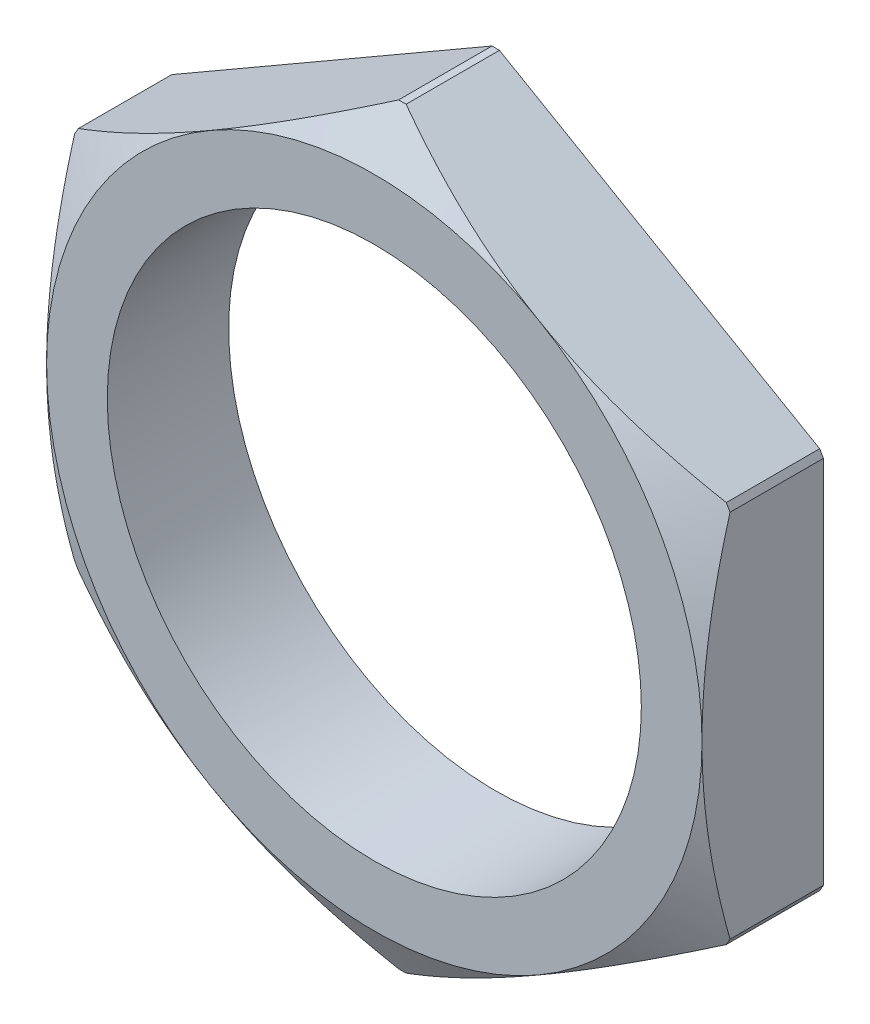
ISO-10303-21;
HEADER;
FILE_DESCRIPTION(('STEP AP214'),'2;1');
FILE_NAME('part.step','',(''),(''),'','','');
FILE_SCHEMA(('AUTOMOTIVE_DESIGN { 1 0 10303 214 1 1 1 1 }'));
ENDSEC;
DATA;
#1=APPLICATION_CONTEXT('core data for automotive mechanical design processes');
#2=APPLICATION_PROTOCOL_DEFINITION('international standard','automotive_design',2000,#1);
#3=PRODUCT_CONTEXT('',#1,'mechanical');
#4=PRODUCT('Part','Part','',(#3));
#5=PRODUCT_RELATED_PRODUCT_CATEGORY('part','',(#4));
#6=PRODUCT_DEFINITION_FORMATION('','',#4);
#7=PRODUCT_DEFINITION_CONTEXT('part definition',#1,'design');
#8=PRODUCT_DEFINITION('design','',#6,#7);
#9=PRODUCT_DEFINITION_SHAPE('','',#8);
#10=(LENGTH_UNIT() NAMED_UNIT(*) SI_UNIT(.MILLI.,.METRE.));
#11=(NAMED_UNIT(*) PLANE_ANGLE_UNIT() SI_UNIT($,.RADIAN.));
#12=(NAMED_UNIT(*) SI_UNIT($,.STERADIAN.) SOLID_ANGLE_UNIT());
#13=UNCERTAINTY_MEASURE_WITH_UNIT(LENGTH_MEASURE(1.E-05),#10,'distance_accuracy_value','');
#14=(GEOMETRIC_REPRESENTATION_CONTEXT(3) GLOBAL_UNCERTAINTY_ASSIGNED_CONTEXT((#13)) GLOBAL_UNIT_ASSIGNED_CONTEXT((#10,
#11,#12)) REPRESENTATION_CONTEXT('',''));
#15=CARTESIAN_POINT('',(0.,0.,0.));
#16=DIRECTION('',(0.,0.,1.));
#17=DIRECTION('',(1.,0.,0.));
#18=AXIS2_PLACEMENT_3D('',#15,#16,#17);
#19=CARTESIAN_POINT('',(0.,0.,5.));
#20=DIRECTION('',(0.,0.,-1.));
#21=DIRECTION('',(-1.,0.,0.));
#22=AXIS2_PLACEMENT_3D('',#19,#20,#21);
#23=CONICAL_SURFACE('',#22,13.5,1.0471975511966);
#24=CARTESIAN_POINT('',(-13.3460635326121,7.88310389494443,3.84509946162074));
#25=CARTESIAN_POINT('',(-13.050624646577,8.05367561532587,3.9418734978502));
#26=CARTESIAN_POINT('',(-12.7540346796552,8.22491191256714,4.03410660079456));
#27=CARTESIAN_POINT('',(-12.1584938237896,8.56874758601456,4.20825527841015));
#28=CARTESIAN_POINT('',(-11.8595421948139,8.74134738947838,4.29016747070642));
#29=CARTESIAN_POINT('',(-11.2587570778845,9.08821083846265,4.44253996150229));
#30=CARTESIAN_POINT('',(-10.9569187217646,9.26247729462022,4.51297485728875));
#31=CARTESIAN_POINT('',(-10.351193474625,9.61219292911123,4.64087642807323));
#32=CARTESIAN_POINT('',(-10.0473067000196,9.78764204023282,4.69834383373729));
#33=CARTESIAN_POINT('',(-9.44511925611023,10.1353151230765,4.79789147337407));
#34=CARTESIAN_POINT('',(-9.14686072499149,10.307514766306,4.84030952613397));
#35=CARTESIAN_POINT('',(-8.54905165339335,10.6526599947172,4.91070012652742));
#36=CARTESIAN_POINT('',(-8.24950108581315,10.8256055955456,4.93867236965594));
#37=CARTESIAN_POINT('',(-7.64996393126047,11.1717485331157,4.97946713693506));
#38=CARTESIAN_POINT('',(-7.34997822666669,11.344945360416,4.99230684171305));
#39=CARTESIAN_POINT('',(-6.74981470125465,11.6914499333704,5.00256554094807));
#40=CARTESIAN_POINT('',(-6.44963688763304,11.8647576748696,4.99998508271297));
#41=CARTESIAN_POINT('',(-5.89855620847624,12.182924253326,4.98114776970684));
#42=CARTESIAN_POINT('',(-5.64759204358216,12.3278184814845,4.96718726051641));
#43=CARTESIAN_POINT('',(-5.14625275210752,12.6172668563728,4.92876258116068));
#44=CARTESIAN_POINT('',(-4.89587766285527,12.7618209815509,4.90429776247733));
#45=CARTESIAN_POINT('',(-4.39584644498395,13.0505141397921,4.84525401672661));
#46=CARTESIAN_POINT('',(-4.14619096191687,13.1946528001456,4.81066783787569));
#47=CARTESIAN_POINT('',(-3.64800506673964,13.4822805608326,4.73193570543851));
#48=CARTESIAN_POINT('',(-3.39947472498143,13.6257696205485,4.68778916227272));
#49=CARTESIAN_POINT('',(-2.64559753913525,14.0610208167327,4.53993928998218));
#50=CARTESIAN_POINT('',(-2.14232624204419,14.3515846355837,4.42208977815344));
#51=CARTESIAN_POINT('',(-1.14286626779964,14.928623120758,4.15536068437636));
#52=CARTESIAN_POINT('',(-0.646666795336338,15.2151040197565,4.00653542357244));
#53=CARTESIAN_POINT('',(-0.153936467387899,15.4995820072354,3.84509946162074));
#54=B_SPLINE_CURVE_WITH_KNOTS('',3,(#24,#25,#26,#27,#28,#29,#30,#31,#32,#33,#34,#35,#36,#37,#38,
#39,#40,#41,#42,#43,#44,#45,#46,#47,#48,#49,#50,#51,#52,#53),.UNSPECIFIED.,.F.,.F.,(4,2,2,2,2,2,
2,2,2,2,2,2,2,2,4),(0.,1.06383959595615,2.12802693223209,3.19453854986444,4.26099005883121,
5.30170918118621,6.34245024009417,7.38200855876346,8.4215299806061,9.29171447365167,
10.161952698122,11.0328159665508,11.9037329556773,13.681588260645,15.4563516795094),.UNSPECIFIED.);
#55=CARTESIAN_POINT('',(-13.3454529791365,7.88345639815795,3.84529946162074));
#56=VERTEX_POINT('',#55);
#57=CARTESIAN_POINT('',(-6.75,11.6913429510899,5.));
#58=VERTEX_POINT('',#57);
#59=EDGE_CURVE('E334',#56,#58,#54,.T.);
#60=ORIENTED_EDGE('',*,*,#59,.F.);
#61=CARTESIAN_POINT('',(0.,0.,3.84529946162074));
#62=DIRECTION('',(0.,0.,-1.));
#63=DIRECTION('',(-1.,0.,0.));
#64=AXIS2_PLACEMENT_3D('',#61,#62,#63);
#65=CIRCLE('',#64,15.5);
#66=CARTESIAN_POINT('',(-13.5,7.61577310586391,3.84529946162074));
#67=VERTEX_POINT('',#66);
#68=EDGE_CURVE('E192',#67,#56,#65,.T.);
#69=ORIENTED_EDGE('',*,*,#68,.F.);
#70=CARTESIAN_POINT('',(-13.5,-20.664360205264,-1.4566869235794));
#71=CARTESIAN_POINT('',(-13.5,-20.3680355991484,-1.31346268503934));
#72=CARTESIAN_POINT('',(-13.5,-20.0713526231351,-1.17098026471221));
#73=CARTESIAN_POINT('',(-13.5,-19.4771942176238,-0.887669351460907));
#74=CARTESIAN_POINT('',(-13.5,-19.1797187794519,-0.746840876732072));
#75=CARTESIAN_POINT('',(-13.5,-18.2859029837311,-0.327050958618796));
#76=CARTESIAN_POINT('',(-13.5,-17.6882695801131,-0.0508317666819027));
#77=CARTESIAN_POINT('',(-13.5,-16.4854470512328,0.494091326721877));
#78=CARTESIAN_POINT('',(-13.5,-15.8802342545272,0.762743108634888));
#79=CARTESIAN_POINT('',(-13.5,-14.6648323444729,1.28850182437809));
#80=CARTESIAN_POINT('',(-13.5,-14.0546434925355,1.54560936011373));
#81=CARTESIAN_POINT('',(-13.5,-12.8207772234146,2.04824093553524));
#82=CARTESIAN_POINT('',(-13.5,-12.1970260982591,2.29358498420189));
#83=CARTESIAN_POINT('',(-13.5,-10.9421598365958,2.76504093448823));
#84=CARTESIAN_POINT('',(-13.5,-10.3110438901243,2.99115069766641));
#85=CARTESIAN_POINT('',(-13.5,-9.04176334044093,3.41805435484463));
#86=CARTESIAN_POINT('',(-13.5,-8.40361701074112,3.61890213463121));
#87=CARTESIAN_POINT('',(-13.5,-7.11819087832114,3.98876427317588));
#88=CARTESIAN_POINT('',(-13.5,-6.470914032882,4.15778869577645));
#89=CARTESIAN_POINT('',(-13.5,-5.49302735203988,4.38126720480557));
#90=CARTESIAN_POINT('',(-13.5,-5.16583222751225,4.45076204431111));
#91=CARTESIAN_POINT('',(-13.5,-4.509265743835,4.57863405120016));
#92=CARTESIAN_POINT('',(-13.5,-4.17989443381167,4.63701146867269));
#93=CARTESIAN_POINT('',(-13.5,-3.51919100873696,4.74161425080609));
#94=CARTESIAN_POINT('',(-13.5,-3.18785873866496,4.78783864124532));
#95=CARTESIAN_POINT('',(-13.5,-2.52363207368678,4.86720376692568));
#96=CARTESIAN_POINT('',(-13.5,-2.19073773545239,4.90034497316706));
#97=CARTESIAN_POINT('',(-13.5,-1.52596312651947,4.95265487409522));
#98=CARTESIAN_POINT('',(-13.5,-1.19408974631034,4.97191056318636));
#99=CARTESIAN_POINT('',(-13.5,-0.529826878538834,4.99634729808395));
#100=CARTESIAN_POINT('',(-13.5,-0.197437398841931,5.00152855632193));
#101=CARTESIAN_POINT('',(-13.5,0.467168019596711,4.99769359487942));
#102=CARTESIAN_POINT('',(-13.5,0.799383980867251,4.98868135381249));
#103=CARTESIAN_POINT('',(-13.5,1.46314646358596,4.95668325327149));
#104=CARTESIAN_POINT('',(-13.5,1.79469294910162,4.93369666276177));
#105=CARTESIAN_POINT('',(-13.5,2.59824248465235,4.86152960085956));
#106=CARTESIAN_POINT('',(-13.5,3.06962908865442,4.80534902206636));
#107=CARTESIAN_POINT('',(-13.5,4.00870475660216,4.66786897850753));
#108=CARTESIAN_POINT('',(-13.5,4.47639326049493,4.58656578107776));
#109=CARTESIAN_POINT('',(-13.5,5.87472987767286,4.30905074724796));
#110=CARTESIAN_POINT('',(-13.5,6.79882179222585,4.07941846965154));
#111=CARTESIAN_POINT('',(-13.5,8.18109511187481,3.6835166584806));
#112=CARTESIAN_POINT('',(-13.5,8.64650005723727,3.54103887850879));
#113=CARTESIAN_POINT('',(-13.5,9.57281363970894,3.24189268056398));
#114=CARTESIAN_POINT('',(-13.5,10.0337218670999,3.0852229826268));
#115=CARTESIAN_POINT('',(-13.5,10.948744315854,2.76103005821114));
#116=CARTESIAN_POINT('',(-13.5,11.4028821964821,2.59357304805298));
#117=CARTESIAN_POINT('',(-13.5,12.0812296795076,2.33514469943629));
#118=CARTESIAN_POINT('',(-13.5,12.306832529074,2.24780955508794));
#119=CARTESIAN_POINT('',(-13.5,12.757162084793,2.07092097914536));
#120=CARTESIAN_POINT('',(-13.5,12.9818888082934,1.98136759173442));
#121=CARTESIAN_POINT('',(-13.5,13.2062078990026,1.89080521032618));
#122=B_SPLINE_CURVE_WITH_KNOTS('',3,(#70,#71,#72,#73,#74,#75,#76,#77,#78,#79,#80,#81,#82,#83,
#84,#85,#86,#87,#88,#89,#90,#91,#92,#93,#94,#95,#96,#97,#98,#99,#100,#101,#102,#103,#104,#105,
#106,#107,#108,#109,#110,#111,#112,#113,#114,#115,#116,#117,#118,#119,#120,#121),.UNSPECIFIED.,
.F.,.F.,(4,2,2,2,2,2,2,2,2,2,2,2,2,2,2,2,2,2,2,2,2,2,2,2,2,4),(0.,0.987364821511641,
1.97474049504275,3.94981332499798,5.93620107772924,7.92248514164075,9.93304684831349,
11.9438317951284,13.950252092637,15.9560368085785,16.9593600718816,17.9626607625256,
18.9660418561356,19.9693868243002,20.9663897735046,21.9633776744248,22.960086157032,
23.9568467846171,25.3802059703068,26.8037767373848,29.6564036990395,31.1164657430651,
32.5766596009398,34.0286157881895,34.7543580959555,35.480085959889),.UNSPECIFIED.);
#123=CARTESIAN_POINT('',(-13.5,0.,5.));
#124=VERTEX_POINT('',#123);
#125=EDGE_CURVE('E315',#124,#67,#122,.T.);
#126=ORIENTED_EDGE('',*,*,#125,.F.);
#127=CARTESIAN_POINT('',(0.,0.,5.));
#128=DIRECTION('',(0.,0.,-1.));
#129=DIRECTION('',(-1.,0.,0.));
#130=AXIS2_PLACEMENT_3D('',#127,#128,#129);
#131=CIRCLE('',#130,13.5);
#132=EDGE_CURVE('E152',#124,#58,#131,.T.);
#133=ORIENTED_EDGE('',*,*,#132,.T.);
#134=EDGE_LOOP('',(#60,#69,#126,#133));
#135=FACE_BOUND('',#134,.T.);
#136=ADVANCED_FACE('F14',(#135),#23,.T.);
#137=CARTESIAN_POINT('',(-13.5,-7.61577310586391,3.84529946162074));
#138=VERTEX_POINT('',#137);
#139=EDGE_CURVE('E322',#138,#124,#122,.T.);
#140=ORIENTED_EDGE('',*,*,#139,.F.);
#141=CARTESIAN_POINT('',(-13.3454529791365,-7.88345639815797,3.84529946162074));
#142=VERTEX_POINT('',#141);
#143=EDGE_CURVE('E142',#142,#138,#65,.T.);
#144=ORIENTED_EDGE('',*,*,#143,.F.);
#145=CARTESIAN_POINT('',(-0.153936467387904,-15.4995820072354,3.84509946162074));
#146=CARTESIAN_POINT('',(-0.44937535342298,-15.329010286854,3.9418734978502));
#147=CARTESIAN_POINT('',(-0.745965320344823,-15.1577739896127,4.03410660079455));
#148=CARTESIAN_POINT('',(-1.34150617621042,-14.8139383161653,4.20825527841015));
#149=CARTESIAN_POINT('',(-1.64045780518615,-14.6413385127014,4.29016747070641));
#150=CARTESIAN_POINT('',(-2.24124292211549,-14.2944750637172,4.44253996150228));
#151=CARTESIAN_POINT('',(-2.54308127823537,-14.1202086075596,4.51297485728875));
#152=CARTESIAN_POINT('',(-3.14880652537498,-13.7704929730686,4.64087642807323));
#153=CARTESIAN_POINT('',(-3.45269329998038,-13.595043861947,4.69834383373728));
#154=CARTESIAN_POINT('',(-4.05488074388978,-13.2473707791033,4.79789147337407));
#155=CARTESIAN_POINT('',(-4.35313927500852,-13.0751711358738,4.84030952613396));
#156=CARTESIAN_POINT('',(-4.95094834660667,-12.7300259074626,4.91070012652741));
#157=CARTESIAN_POINT('',(-5.25049891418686,-12.5570803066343,4.93867236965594));
#158=CARTESIAN_POINT('',(-5.85003606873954,-12.2109373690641,4.97946713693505));
#159=CARTESIAN_POINT('',(-6.15002177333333,-12.0377405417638,4.99230684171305));
#160=CARTESIAN_POINT('',(-6.75018529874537,-11.6912359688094,5.00256554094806));
#161=CARTESIAN_POINT('',(-7.05036311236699,-11.5179282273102,4.99998508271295));
#162=CARTESIAN_POINT('',(-7.60144379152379,-11.1997616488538,4.98114776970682));
#163=CARTESIAN_POINT('',(-7.85240795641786,-11.0548674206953,4.9671872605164));
#164=CARTESIAN_POINT('',(-8.35374724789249,-10.7654190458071,4.92876258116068));
#165=CARTESIAN_POINT('',(-8.60412233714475,-10.6208649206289,4.90429776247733));
#166=CARTESIAN_POINT('',(-9.10415355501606,-10.3321717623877,4.8452540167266));
#167=CARTESIAN_POINT('',(-9.35380903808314,-10.1880331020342,4.81066783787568));
#168=CARTESIAN_POINT('',(-9.85199493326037,-9.9004053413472,4.7319357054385));
#169=CARTESIAN_POINT('',(-10.1005252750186,-9.7569162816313,4.68778916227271));
#170=CARTESIAN_POINT('',(-10.8544024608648,-9.32166508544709,4.53993928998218));
#171=CARTESIAN_POINT('',(-11.3576737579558,-9.03110126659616,4.42208977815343));
#172=CARTESIAN_POINT('',(-12.3571337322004,-8.45406278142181,4.15536068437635));
#173=CARTESIAN_POINT('',(-12.8533332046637,-8.16758188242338,4.00653542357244));
#174=CARTESIAN_POINT('',(-13.3460635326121,-7.88310389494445,3.84509946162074));
#175=B_SPLINE_CURVE_WITH_KNOTS('',3,(#145,#146,#147,#148,#149,#150,#151,#152,#153,#154,#155,
#156,#157,#158,#159,#160,#161,#162,#163,#164,#165,#166,#167,#168,#169,#170,#171,#172,#173,#174),
.UNSPECIFIED.,.F.,.F.,(4,2,2,2,2,2,2,2,2,2,2,2,2,2,4),(0.,1.06383959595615,2.12802693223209,
3.19453854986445,4.26099005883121,5.30170918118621,6.34245024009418,7.38200855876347,
8.42152998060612,9.29171447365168,10.161952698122,11.0328159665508,11.9037329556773,
13.681588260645,15.4563516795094),.UNSPECIFIED.);
#176=CARTESIAN_POINT('',(-6.75,-11.6913429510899,5.));
#177=VERTEX_POINT('',#176);
#178=EDGE_CURVE('E124',#177,#142,#175,.T.);
#179=ORIENTED_EDGE('',*,*,#178,.F.);
#180=EDGE_CURVE('E140',#177,#124,#131,.T.);
#181=ORIENTED_EDGE('',*,*,#180,.T.);
#182=EDGE_LOOP('',(#140,#144,#179,#181));
#183=FACE_BOUND('',#182,.T.);
#184=ADVANCED_FACE('F139',(#183),#23,.T.);
#185=CARTESIAN_POINT('',(-0.154547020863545,-15.4992295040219,3.84529946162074));
#186=VERTEX_POINT('',#185);
#187=EDGE_CURVE('E121',#186,#177,#175,.T.);
#188=ORIENTED_EDGE('',*,*,#187,.F.);
#189=CARTESIAN_POINT('',(0.15454702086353,-15.4992295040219,3.84529946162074));
#190=VERTEX_POINT('',#189);
#191=EDGE_CURVE('E271',#190,#186,#65,.T.);
#192=ORIENTED_EDGE('',*,*,#191,.F.);
#193=CARTESIAN_POINT('',(13.3460635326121,-7.88310389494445,3.84509946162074));
#194=CARTESIAN_POINT('',(13.050624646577,-8.05367561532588,3.9418734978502));
#195=CARTESIAN_POINT('',(12.7540346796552,-8.22491191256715,4.03410660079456));
#196=CARTESIAN_POINT('',(12.1584938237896,-8.56874758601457,4.20825527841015));
#197=CARTESIAN_POINT('',(11.8595421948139,-8.74134738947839,4.29016747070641));
#198=CARTESIAN_POINT('',(11.2587570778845,-9.08821083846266,4.44253996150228));
#199=CARTESIAN_POINT('',(10.9569187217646,-9.26247729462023,4.51297485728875));
#200=CARTESIAN_POINT('',(10.351193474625,-9.61219292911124,4.64087642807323));
#201=CARTESIAN_POINT('',(10.0473067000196,-9.78764204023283,4.69834383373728));
#202=CARTESIAN_POINT('',(9.44511925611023,-10.1353151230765,4.79789147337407));
#203=CARTESIAN_POINT('',(9.14686072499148,-10.307514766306,4.84030952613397));
#204=CARTESIAN_POINT('',(8.54905165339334,-10.6526599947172,4.91070012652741));
#205=CARTESIAN_POINT('',(8.24950108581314,-10.8256055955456,4.93867236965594));
#206=CARTESIAN_POINT('',(7.64996393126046,-11.1717485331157,4.97946713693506));
#207=CARTESIAN_POINT('',(7.34997822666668,-11.344945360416,4.99230684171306));
#208=CARTESIAN_POINT('',(6.74981470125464,-11.6914499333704,5.00256554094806));
#209=CARTESIAN_POINT('',(6.44963688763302,-11.8647576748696,4.99998508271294));
#210=CARTESIAN_POINT('',(5.89855620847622,-12.182924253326,4.98114776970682));
#211=CARTESIAN_POINT('',(5.64759204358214,-12.3278184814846,4.9671872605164));
#212=CARTESIAN_POINT('',(5.14625275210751,-12.6172668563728,4.92876258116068));
#213=CARTESIAN_POINT('',(4.89587766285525,-12.7618209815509,4.90429776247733));
#214=CARTESIAN_POINT('',(4.39584644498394,-13.0505141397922,4.84525401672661));
#215=CARTESIAN_POINT('',(4.14619096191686,-13.1946528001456,4.81066783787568));
#216=CARTESIAN_POINT('',(3.64800506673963,-13.4822805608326,4.7319357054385));
#217=CARTESIAN_POINT('',(3.39947472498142,-13.6257696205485,4.68778916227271));
#218=CARTESIAN_POINT('',(2.64559753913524,-14.0610208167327,4.53993928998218));
#219=CARTESIAN_POINT('',(2.14232624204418,-14.3515846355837,4.42208977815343));
#220=CARTESIAN_POINT('',(1.14286626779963,-14.928623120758,4.15536068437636));
#221=CARTESIAN_POINT('',(0.646666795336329,-15.2151040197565,4.00653542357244));
#222=CARTESIAN_POINT('',(0.15393646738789,-15.4995820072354,3.84509946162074));
#223=B_SPLINE_CURVE_WITH_KNOTS('',3,(#193,#194,#195,#196,#197,#198,#199,#200,#201,#202,#203,
#204,#205,#206,#207,#208,#209,#210,#211,#212,#213,#214,#215,#216,#217,#218,#219,#220,#221,#222),
.UNSPECIFIED.,.F.,.F.,(4,2,2,2,2,2,2,2,2,2,2,2,2,2,4),(0.,1.06383959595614,2.12802693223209,
3.19453854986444,4.26099005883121,5.30170918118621,6.34245024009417,7.38200855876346,
8.42152998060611,9.29171447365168,10.161952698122,11.0328159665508,11.9037329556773,
13.681588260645,15.4563516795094),.UNSPECIFIED.);
#224=CARTESIAN_POINT('',(6.75,-11.6913429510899,5.));
#225=VERTEX_POINT('',#224);
#226=EDGE_CURVE('E156',#225,#190,#223,.T.);
#227=ORIENTED_EDGE('',*,*,#226,.F.);
#228=EDGE_CURVE('E149',#225,#177,#131,.T.);
#229=ORIENTED_EDGE('',*,*,#228,.T.);
#230=EDGE_LOOP('',(#188,#192,#227,#229));
#231=FACE_BOUND('',#230,.T.);
#232=ADVANCED_FACE('F155',(#231),#23,.T.);
#233=CARTESIAN_POINT('',(0.,0.,-10.));
#234=DIRECTION('',(0.,0.,-1.));
#235=DIRECTION('',(-1.,0.,0.));
#236=AXIS2_PLACEMENT_3D('',#233,#234,#235);
#237=CYLINDRICAL_SURFACE('',#236,15.5);
#238=DIRECTION('',(0.,0.,-1.));
#239=VECTOR('',#238,1.);
#240=CARTESIAN_POINT('',(-13.3454529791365,7.88345639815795,-10.));
#241=LINE('',#240,#239);
#242=CARTESIAN_POINT('',(-13.3454529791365,7.88345639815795,0.));
#243=VERTEX_POINT('',#242);
#244=EDGE_CURVE('E325',#243,#56,#241,.F.);
#245=ORIENTED_EDGE('',*,*,#244,.F.);
#246=CARTESIAN_POINT('',(0.,0.,0.));
#247=DIRECTION('',(0.,0.,-1.));
#248=DIRECTION('',(-1.,0.,0.));
#249=AXIS2_PLACEMENT_3D('',#246,#247,#248);
#250=CIRCLE('',#249,15.5);
#251=CARTESIAN_POINT('',(-13.5,7.61577310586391,0.));
#252=VERTEX_POINT('',#251);
#253=EDGE_CURVE('E193',#252,#243,#250,.T.);
#254=ORIENTED_EDGE('',*,*,#253,.F.);
#255=DIRECTION('',(0.,0.,-1.));
#256=VECTOR('',#255,1.);
#257=CARTESIAN_POINT('',(-13.5,7.61577310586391,-10.));
#258=LINE('',#257,#256);
#259=EDGE_CURVE('E37',#67,#252,#258,.T.);
#260=ORIENTED_EDGE('',*,*,#259,.F.);
#261=ORIENTED_EDGE('',*,*,#68,.T.);
#262=EDGE_LOOP('',(#245,#254,#260,#261));
#263=FACE_BOUND('',#262,.T.);
#264=ADVANCED_FACE('F219',(#263),#237,.T.);
#265=DIRECTION('',(0.,0.,-1.));
#266=VECTOR('',#265,1.);
#267=CARTESIAN_POINT('',(-13.5,-7.61577310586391,-10.));
#268=LINE('',#267,#266);
#269=CARTESIAN_POINT('',(-13.5,-7.61577310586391,0.));
#270=VERTEX_POINT('',#269);
#271=EDGE_CURVE('E480',#270,#138,#268,.F.);
#272=ORIENTED_EDGE('',*,*,#271,.F.);
#273=CARTESIAN_POINT('',(-13.3454529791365,-7.88345639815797,0.));
#274=VERTEX_POINT('',#273);
#275=EDGE_CURVE('E282',#274,#270,#250,.T.);
#276=ORIENTED_EDGE('',*,*,#275,.F.);
#277=DIRECTION('',(0.,0.,-1.));
#278=VECTOR('',#277,1.);
#279=CARTESIAN_POINT('',(-13.3454529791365,-7.88345639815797,-10.));
#280=LINE('',#279,#278);
#281=EDGE_CURVE('E143',#142,#274,#280,.T.);
#282=ORIENTED_EDGE('',*,*,#281,.F.);
#283=ORIENTED_EDGE('',*,*,#143,.T.);
#284=EDGE_LOOP('',(#272,#276,#282,#283));
#285=FACE_BOUND('',#284,.T.);
#286=ADVANCED_FACE('F221',(#285),#237,.T.);
#287=DIRECTION('',(0.,0.,-1.));
#288=VECTOR('',#287,1.);
#289=CARTESIAN_POINT('',(-0.154547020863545,-15.4992295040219,-10.));
#290=LINE('',#289,#288);
#291=CARTESIAN_POINT('',(-0.154547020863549,-15.4992295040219,0.));
#292=VERTEX_POINT('',#291);
#293=EDGE_CURVE('E127',#292,#186,#290,.F.);
#294=ORIENTED_EDGE('',*,*,#293,.F.);
#295=CARTESIAN_POINT('',(0.154547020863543,-15.4992295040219,0.));
#296=VERTEX_POINT('',#295);
#297=EDGE_CURVE('E194',#296,#292,#250,.T.);
#298=ORIENTED_EDGE('',*,*,#297,.F.);
#299=DIRECTION('',(0.,0.,-1.));
#300=VECTOR('',#299,1.);
#301=CARTESIAN_POINT('',(0.15454702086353,-15.4992295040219,-10.));
#302=LINE('',#301,#300);
#303=EDGE_CURVE('E203',#190,#296,#302,.T.);
#304=ORIENTED_EDGE('',*,*,#303,.F.);
#305=ORIENTED_EDGE('',*,*,#191,.T.);
#306=EDGE_LOOP('',(#294,#298,#304,#305));
#307=FACE_BOUND('',#306,.T.);
#308=ADVANCED_FACE('F217',(#307),#237,.T.);
#309=CARTESIAN_POINT('',(0.,15.5,0.));
#310=DIRECTION('',(0.,0.,1.));
#311=DIRECTION('',(1.,0.,0.));
#312=AXIS2_PLACEMENT_3D('',#309,#310,#311);
#313=PLANE('',#312);
#314=CARTESIAN_POINT('',(0.,0.,0.));
#315=DIRECTION('',(0.,0.,1.));
#316=DIRECTION('',(1.,0.,0.));
#317=AXIS2_PLACEMENT_3D('',#314,#315,#316);
#318=CIRCLE('',#317,11.);
#319=CARTESIAN_POINT('',(11.,0.,0.));
#320=VERTEX_POINT('',#319);
#321=EDGE_CURVE('E293',#320,#320,#318,.T.);
#322=ORIENTED_EDGE('',*,*,#321,.T.);
#323=EDGE_LOOP('',(#322));
#324=FACE_BOUND('',#323,.T.);
#325=DIRECTION('',(-0.866025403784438,-0.5,0.));
#326=VECTOR('',#325,1.);
#327=CARTESIAN_POINT('',(-0.0383031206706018,15.5663429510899,0.));
#328=LINE('',#327,#326);
#329=CARTESIAN_POINT('',(-0.154547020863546,15.4992295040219,0.));
#330=VERTEX_POINT('',#329);
#331=EDGE_CURVE('E323',#330,#243,#328,.T.);
#332=ORIENTED_EDGE('',*,*,#331,.F.);
#333=CARTESIAN_POINT('',(0.154547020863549,15.4992295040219,0.));
#334=VERTEX_POINT('',#333);
#335=EDGE_CURVE('E29',#330,#334,#250,.T.);
#336=ORIENTED_EDGE('',*,*,#335,.T.);
#337=DIRECTION('',(-0.866025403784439,0.5,0.));
#338=VECTOR('',#337,1.);
#339=CARTESIAN_POINT('',(0.0383031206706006,15.5663429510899,0.));
#340=LINE('',#339,#338);
#341=CARTESIAN_POINT('',(13.3454529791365,7.88345639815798,0.));
#342=VERTEX_POINT('',#341);
#343=EDGE_CURVE('E163',#342,#334,#340,.T.);
#344=ORIENTED_EDGE('',*,*,#343,.F.);
#345=CARTESIAN_POINT('',(13.5,7.61577310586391,0.));
#346=VERTEX_POINT('',#345);
#347=EDGE_CURVE('E183',#342,#346,#250,.T.);
#348=ORIENTED_EDGE('',*,*,#347,.T.);
#349=DIRECTION('',(0.,1.,0.));
#350=VECTOR('',#349,1.);
#351=CARTESIAN_POINT('',(13.5,15.5,0.));
#352=LINE('',#351,#350);
#353=CARTESIAN_POINT('',(13.5,-7.61577310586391,0.));
#354=VERTEX_POINT('',#353);
#355=EDGE_CURVE('E22',#354,#346,#352,.T.);
#356=ORIENTED_EDGE('',*,*,#355,.F.);
#357=CARTESIAN_POINT('',(13.3454529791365,-7.88345639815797,0.));
#358=VERTEX_POINT('',#357);
#359=EDGE_CURVE('E191',#354,#358,#250,.T.);
#360=ORIENTED_EDGE('',*,*,#359,.T.);
#361=DIRECTION('',(0.866025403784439,0.5,0.));
#362=VECTOR('',#361,1.);
#363=CARTESIAN_POINT('',(13.4616968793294,-7.81634295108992,0.));
#364=LINE('',#363,#362);
#365=EDGE_CURVE('E9',#296,#358,#364,.T.);
#366=ORIENTED_EDGE('',*,*,#365,.F.);
#367=ORIENTED_EDGE('',*,*,#297,.T.);
#368=DIRECTION('',(0.866025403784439,-0.5,0.));
#369=VECTOR('',#368,1.);
#370=CARTESIAN_POINT('',(-13.4616968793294,-7.81634295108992,0.));
#371=LINE('',#370,#369);
#372=EDGE_CURVE('E290',#274,#292,#371,.T.);
#373=ORIENTED_EDGE('',*,*,#372,.F.);
#374=ORIENTED_EDGE('',*,*,#275,.T.);
#375=DIRECTION('',(0.,-1.,0.));
#376=VECTOR('',#375,1.);
#377=CARTESIAN_POINT('',(-13.5,15.5,0.));
#378=LINE('',#377,#376);
#379=EDGE_CURVE('E132',#252,#270,#378,.T.);
#380=ORIENTED_EDGE('',*,*,#379,.F.);
#381=ORIENTED_EDGE('',*,*,#253,.T.);
#382=EDGE_LOOP('',(#332,#336,#344,#348,#356,#360,#366,#367,#373,#374,#380,#381));
#383=FACE_BOUND('',#382,.T.);
#384=ADVANCED_FACE('F190',(#324,#383),#313,.F.);
#385=CARTESIAN_POINT('',(13.3454529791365,-7.88345639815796,3.84529946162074));
#386=VERTEX_POINT('',#385);
#387=EDGE_CURVE('E202',#386,#225,#223,.T.);
#388=ORIENTED_EDGE('',*,*,#387,.F.);
#389=CARTESIAN_POINT('',(13.5,-7.61577310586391,3.84529946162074));
#390=VERTEX_POINT('',#389);
#391=EDGE_CURVE('E268',#390,#386,#65,.T.);
#392=ORIENTED_EDGE('',*,*,#391,.F.);
#393=CARTESIAN_POINT('',(13.5,-20.664360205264,-1.45668692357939));
#394=CARTESIAN_POINT('',(13.5,-20.3680355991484,-1.31346268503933));
#395=CARTESIAN_POINT('',(13.5,-20.0713526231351,-1.17098026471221));
#396=CARTESIAN_POINT('',(13.5,-19.4771942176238,-0.887669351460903));
#397=CARTESIAN_POINT('',(13.5,-19.1797187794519,-0.746840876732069));
#398=CARTESIAN_POINT('',(13.5,-18.2859029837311,-0.327050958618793));
#399=CARTESIAN_POINT('',(13.5,-17.6882695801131,-0.0508317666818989));
#400=CARTESIAN_POINT('',(13.5,-16.4854470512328,0.494091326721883));
#401=CARTESIAN_POINT('',(13.5,-15.8802342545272,0.762743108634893));
#402=CARTESIAN_POINT('',(13.5,-14.6648323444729,1.2885018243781));
#403=CARTESIAN_POINT('',(13.5,-14.0546434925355,1.54560936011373));
#404=CARTESIAN_POINT('',(13.5,-12.8207772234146,2.04824093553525));
#405=CARTESIAN_POINT('',(13.5,-12.1970260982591,2.29358498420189));
#406=CARTESIAN_POINT('',(13.5,-10.9421598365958,2.76504093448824));
#407=CARTESIAN_POINT('',(13.5,-10.3110438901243,2.99115069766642));
#408=CARTESIAN_POINT('',(13.5,-9.04176334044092,3.41805435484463));
#409=CARTESIAN_POINT('',(13.5,-8.40361701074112,3.61890213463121));
#410=CARTESIAN_POINT('',(13.5,-7.11819087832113,3.98876427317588));
#411=CARTESIAN_POINT('',(13.5,-6.47091403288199,4.15778869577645));
#412=CARTESIAN_POINT('',(13.5,-5.49302735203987,4.38126720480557));
#413=CARTESIAN_POINT('',(13.5,-5.16583222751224,4.45076204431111));
#414=CARTESIAN_POINT('',(13.5,-4.50926574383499,4.57863405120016));
#415=CARTESIAN_POINT('',(13.5,-4.17989443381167,4.63701146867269));
#416=CARTESIAN_POINT('',(13.5,-3.51919100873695,4.74161425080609));
#417=CARTESIAN_POINT('',(13.5,-3.18785873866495,4.78783864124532));
#418=CARTESIAN_POINT('',(13.5,-2.52363207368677,4.86720376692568));
#419=CARTESIAN_POINT('',(13.5,-2.19073773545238,4.90034497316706));
#420=CARTESIAN_POINT('',(13.5,-1.52596312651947,4.95265487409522));
#421=CARTESIAN_POINT('',(13.5,-1.19408974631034,4.97191056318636));
#422=CARTESIAN_POINT('',(13.5,-0.529826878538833,4.99634729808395));
#423=CARTESIAN_POINT('',(13.5,-0.197437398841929,5.00152855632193));
#424=CARTESIAN_POINT('',(13.5,0.467168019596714,4.99769359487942));
#425=CARTESIAN_POINT('',(13.5,0.799383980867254,4.98868135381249));
#426=CARTESIAN_POINT('',(13.5,1.46314646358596,4.95668325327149));
#427=CARTESIAN_POINT('',(13.5,1.79469294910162,4.93369666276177));
#428=CARTESIAN_POINT('',(13.5,2.59824248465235,4.86152960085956));
#429=CARTESIAN_POINT('',(13.5,3.06962908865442,4.80534902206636));
#430=CARTESIAN_POINT('',(13.5,4.00870475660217,4.66786897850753));
#431=CARTESIAN_POINT('',(13.5,4.47639326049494,4.58656578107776));
#432=CARTESIAN_POINT('',(13.5,5.87472987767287,4.30905074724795));
#433=CARTESIAN_POINT('',(13.5,6.79882179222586,4.07941846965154));
#434=CARTESIAN_POINT('',(13.5,8.18109511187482,3.6835166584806));
#435=CARTESIAN_POINT('',(13.5,8.64650005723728,3.54103887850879));
#436=CARTESIAN_POINT('',(13.5,9.57281363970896,3.24189268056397));
#437=CARTESIAN_POINT('',(13.5,10.0337218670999,3.08522298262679));
#438=CARTESIAN_POINT('',(13.5,10.9487443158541,2.76103005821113));
#439=CARTESIAN_POINT('',(13.5,11.4028821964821,2.59357304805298));
#440=CARTESIAN_POINT('',(13.5,12.0812296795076,2.33514469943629));
#441=CARTESIAN_POINT('',(13.5,12.306832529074,2.24780955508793));
#442=CARTESIAN_POINT('',(13.5,12.757162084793,2.07092097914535));
#443=CARTESIAN_POINT('',(13.5,12.9818888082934,1.98136759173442));
#444=CARTESIAN_POINT('',(13.5,13.2062078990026,1.89080521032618));
#445=B_SPLINE_CURVE_WITH_KNOTS('',3,(#393,#394,#395,#396,#397,#398,#399,#400,#401,#402,#403,
#404,#405,#406,#407,#408,#409,#410,#411,#412,#413,#414,#415,#416,#417,#418,#419,#420,#421,#422,
#423,#424,#425,#426,#427,#428,#429,#430,#431,#432,#433,#434,#435,#436,#437,#438,#439,#440,#441,
#442,#443,#444),.UNSPECIFIED.,.F.,.F.,(4,2,2,2,2,2,2,2,2,2,2,2,2,2,2,2,2,2,2,2,2,2,2,2,2,4),(0.,
0.987364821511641,1.97474049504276,3.94981332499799,5.93620107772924,7.92248514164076,
9.93304684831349,11.9438317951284,13.950252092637,15.9560368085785,16.9593600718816,
17.9626607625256,18.9660418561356,19.9693868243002,20.9663897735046,21.9633776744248,
22.960086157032,23.9568467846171,25.3802059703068,26.8037767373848,29.6564036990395,
31.1164657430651,32.5766596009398,34.0286157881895,34.7543580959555,35.480085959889),.UNSPECIFIED.);
#446=CARTESIAN_POINT('',(13.5,0.,5.));
#447=VERTEX_POINT('',#446);
#448=EDGE_CURVE('E280',#447,#390,#445,.F.);
#449=ORIENTED_EDGE('',*,*,#448,.F.);
#450=EDGE_CURVE('E157',#447,#225,#131,.T.);
#451=ORIENTED_EDGE('',*,*,#450,.T.);
#452=EDGE_LOOP('',(#388,#392,#449,#451));
#453=FACE_BOUND('',#452,.T.);
#454=ADVANCED_FACE('F205',(#453),#23,.T.);
#455=CARTESIAN_POINT('',(13.5,7.61577310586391,3.84529946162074));
#456=VERTEX_POINT('',#455);
#457=EDGE_CURVE('E489',#456,#447,#445,.F.);
#458=ORIENTED_EDGE('',*,*,#457,.F.);
#459=CARTESIAN_POINT('',(13.3454529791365,7.88345639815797,3.84529946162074));
#460=VERTEX_POINT('',#459);
#461=EDGE_CURVE('E185',#460,#456,#65,.T.);
#462=ORIENTED_EDGE('',*,*,#461,.F.);
#463=CARTESIAN_POINT('',(0.153936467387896,15.4995820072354,3.84509946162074));
#464=CARTESIAN_POINT('',(0.449375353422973,15.329010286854,3.9418734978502));
#465=CARTESIAN_POINT('',(0.745965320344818,15.1577739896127,4.03410660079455));
#466=CARTESIAN_POINT('',(1.34150617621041,14.8139383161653,4.20825527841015));
#467=CARTESIAN_POINT('',(1.64045780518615,14.6413385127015,4.29016747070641));
#468=CARTESIAN_POINT('',(2.24124292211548,14.2944750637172,4.44253996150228));
#469=CARTESIAN_POINT('',(2.54308127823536,14.1202086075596,4.51297485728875));
#470=CARTESIAN_POINT('',(3.14880652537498,13.7704929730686,4.64087642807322));
#471=CARTESIAN_POINT('',(3.45269329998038,13.595043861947,4.69834383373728));
#472=CARTESIAN_POINT('',(4.05488074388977,13.2473707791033,4.79789147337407));
#473=CARTESIAN_POINT('',(4.35313927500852,13.0751711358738,4.84030952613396));
#474=CARTESIAN_POINT('',(4.95094834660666,12.7300259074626,4.91070012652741));
#475=CARTESIAN_POINT('',(5.25049891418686,12.5570803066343,4.93867236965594));
#476=CARTESIAN_POINT('',(5.85003606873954,12.2109373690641,4.97946713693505));
#477=CARTESIAN_POINT('',(6.15002177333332,12.0377405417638,4.99230684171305));
#478=CARTESIAN_POINT('',(6.75018529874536,11.6912359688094,5.00256554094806));
#479=CARTESIAN_POINT('',(7.05036311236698,11.5179282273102,4.99998508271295));
#480=CARTESIAN_POINT('',(7.60144379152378,11.1997616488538,4.98114776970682));
#481=CARTESIAN_POINT('',(7.85240795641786,11.0548674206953,4.9671872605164));
#482=CARTESIAN_POINT('',(8.35374724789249,10.7654190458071,4.92876258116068));
#483=CARTESIAN_POINT('',(8.60412233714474,10.6208649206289,4.90429776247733));
#484=CARTESIAN_POINT('',(9.10415355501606,10.3321717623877,4.8452540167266));
#485=CARTESIAN_POINT('',(9.35380903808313,10.1880331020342,4.81066783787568));
#486=CARTESIAN_POINT('',(9.85199493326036,9.9004053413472,4.7319357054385));
#487=CARTESIAN_POINT('',(10.1005252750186,9.7569162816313,4.68778916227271));
#488=CARTESIAN_POINT('',(10.8544024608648,9.3216650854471,4.53993928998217));
#489=CARTESIAN_POINT('',(11.3576737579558,9.03110126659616,4.42208977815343));
#490=CARTESIAN_POINT('',(12.3571337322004,8.45406278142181,4.15536068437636));
#491=CARTESIAN_POINT('',(12.8533332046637,8.16758188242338,4.00653542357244));
#492=CARTESIAN_POINT('',(13.3460635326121,7.88310389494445,3.84509946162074));
#493=B_SPLINE_CURVE_WITH_KNOTS('',3,(#463,#464,#465,#466,#467,#468,#469,#470,#471,#472,#473,
#474,#475,#476,#477,#478,#479,#480,#481,#482,#483,#484,#485,#486,#487,#488,#489,#490,#491,#492),
.UNSPECIFIED.,.F.,.F.,(4,2,2,2,2,2,2,2,2,2,2,2,2,2,4),(0.,1.06383959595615,2.12802693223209,
3.19453854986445,4.26099005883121,5.30170918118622,6.34245024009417,7.38200855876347,
8.42152998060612,9.29171447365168,10.161952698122,11.0328159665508,11.9037329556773,
13.681588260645,15.4563516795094),.UNSPECIFIED.);
#494=CARTESIAN_POINT('',(6.75,11.6913429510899,5.));
#495=VERTEX_POINT('',#494);
#496=EDGE_CURVE('E264',#495,#460,#493,.T.);
#497=ORIENTED_EDGE('',*,*,#496,.F.);
#498=EDGE_CURVE('E158',#495,#447,#131,.T.);
#499=ORIENTED_EDGE('',*,*,#498,.T.);
#500=EDGE_LOOP('',(#458,#462,#497,#499));
#501=FACE_BOUND('',#500,.T.);
#502=ADVANCED_FACE('F231',(#501),#23,.T.);
#503=CARTESIAN_POINT('',(0.154547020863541,15.4992295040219,3.84529946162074));
#504=VERTEX_POINT('',#503);
#505=EDGE_CURVE('E186',#504,#495,#493,.T.);
#506=ORIENTED_EDGE('',*,*,#505,.F.);
#507=CARTESIAN_POINT('',(-0.154547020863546,15.4992295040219,3.84529946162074));
#508=VERTEX_POINT('',#507);
#509=EDGE_CURVE('E164',#508,#504,#65,.T.);
#510=ORIENTED_EDGE('',*,*,#509,.F.);
#511=EDGE_CURVE('E328',#58,#508,#54,.T.);
#512=ORIENTED_EDGE('',*,*,#511,.F.);
#513=EDGE_CURVE('E159',#58,#495,#131,.T.);
#514=ORIENTED_EDGE('',*,*,#513,.T.);
#515=EDGE_LOOP('',(#506,#510,#512,#514));
#516=FACE_BOUND('',#515,.T.);
#517=ADVANCED_FACE('F243',(#516),#23,.T.);
#518=DIRECTION('',(0.,0.,-1.));
#519=VECTOR('',#518,1.);
#520=CARTESIAN_POINT('',(13.3454529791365,-7.88345639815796,-10.));
#521=LINE('',#520,#519);
#522=EDGE_CURVE('E278',#358,#386,#521,.F.);
#523=ORIENTED_EDGE('',*,*,#522,.F.);
#524=ORIENTED_EDGE('',*,*,#359,.F.);
#525=DIRECTION('',(0.,0.,-1.));
#526=VECTOR('',#525,1.);
#527=CARTESIAN_POINT('',(13.5,-7.61577310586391,-10.));
#528=LINE('',#527,#526);
#529=EDGE_CURVE('E173',#390,#354,#528,.T.);
#530=ORIENTED_EDGE('',*,*,#529,.F.);
#531=ORIENTED_EDGE('',*,*,#391,.T.);
#532=EDGE_LOOP('',(#523,#524,#530,#531));
#533=FACE_BOUND('',#532,.T.);
#534=ADVANCED_FACE('F251',(#533),#237,.T.);
#535=DIRECTION('',(0.,0.,-1.));
#536=VECTOR('',#535,1.);
#537=CARTESIAN_POINT('',(13.5,7.61577310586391,-10.));
#538=LINE('',#537,#536);
#539=EDGE_CURVE('E170',#346,#456,#538,.F.);
#540=ORIENTED_EDGE('',*,*,#539,.F.);
#541=ORIENTED_EDGE('',*,*,#347,.F.);
#542=DIRECTION('',(0.,0.,-1.));
#543=VECTOR('',#542,1.);
#544=CARTESIAN_POINT('',(13.3454529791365,7.88345639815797,-10.));
#545=LINE('',#544,#543);
#546=EDGE_CURVE('E336',#460,#342,#545,.T.);
#547=ORIENTED_EDGE('',*,*,#546,.F.);
#548=ORIENTED_EDGE('',*,*,#461,.T.);
#549=EDGE_LOOP('',(#540,#541,#547,#548));
#550=FACE_BOUND('',#549,.T.);
#551=ADVANCED_FACE('F181',(#550),#237,.T.);
#552=DIRECTION('',(0.,0.,-1.));
#553=VECTOR('',#552,1.);
#554=CARTESIAN_POINT('',(0.154547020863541,15.4992295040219,-10.));
#555=LINE('',#554,#553);
#556=EDGE_CURVE('E266',#334,#504,#555,.F.);
#557=ORIENTED_EDGE('',*,*,#556,.F.);
#558=ORIENTED_EDGE('',*,*,#335,.F.);
#559=DIRECTION('',(0.,0.,-1.));
#560=VECTOR('',#559,1.);
#561=CARTESIAN_POINT('',(-0.154547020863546,15.4992295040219,-10.));
#562=LINE('',#561,#560);
#563=EDGE_CURVE('E267',#508,#330,#562,.T.);
#564=ORIENTED_EDGE('',*,*,#563,.F.);
#565=ORIENTED_EDGE('',*,*,#509,.T.);
#566=EDGE_LOOP('',(#557,#558,#564,#565));
#567=FACE_BOUND('',#566,.T.);
#568=ADVANCED_FACE('F223',(#567),#237,.T.);
#569=CARTESIAN_POINT('',(0.,0.,5.));
#570=DIRECTION('',(0.,0.,-1.));
#571=DIRECTION('',(-1.,0.,0.));
#572=AXIS2_PLACEMENT_3D('',#569,#570,#571);
#573=PLANE('',#572);
#574=ORIENTED_EDGE('',*,*,#513,.F.);
#575=ORIENTED_EDGE('',*,*,#132,.F.);
#576=ORIENTED_EDGE('',*,*,#180,.F.);
#577=ORIENTED_EDGE('',*,*,#228,.F.);
#578=ORIENTED_EDGE('',*,*,#450,.F.);
#579=ORIENTED_EDGE('',*,*,#498,.F.);
#580=EDGE_LOOP('',(#574,#575,#576,#577,#578,#579));
#581=FACE_BOUND('',#580,.T.);
#582=CARTESIAN_POINT('',(0.,0.,5.));
#583=DIRECTION('',(0.,0.,-1.));
#584=DIRECTION('',(-1.,0.,0.));
#585=AXIS2_PLACEMENT_3D('',#582,#583,#584);
#586=CIRCLE('',#585,11.);
#587=CARTESIAN_POINT('',(-11.,0.,5.));
#588=VERTEX_POINT('',#587);
#589=EDGE_CURVE('E474',#588,#588,#586,.T.);
#590=ORIENTED_EDGE('',*,*,#589,.T.);
#591=EDGE_LOOP('',(#590));
#592=FACE_BOUND('',#591,.T.);
#593=ADVANCED_FACE('F16',(#581,#592),#573,.F.);
#594=CARTESIAN_POINT('',(13.5,7.79422863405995,-4.));
#595=DIRECTION('',(0.5,0.866025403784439,0.));
#596=DIRECTION('',(0.866025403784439,-0.5,0.));
#597=AXIS2_PLACEMENT_3D('',#594,#595,#596);
#598=PLANE('',#597);
#599=ORIENTED_EDGE('',*,*,#505,.T.);
#600=ORIENTED_EDGE('',*,*,#496,.T.);
#601=ORIENTED_EDGE('',*,*,#546,.T.);
#602=ORIENTED_EDGE('',*,*,#343,.T.);
#603=ORIENTED_EDGE('',*,*,#556,.T.);
#604=EDGE_LOOP('',(#599,#600,#601,#602,#603));
#605=FACE_BOUND('',#604,.T.);
#606=ADVANCED_FACE('F342',(#605),#598,.T.);
#607=CARTESIAN_POINT('',(13.5,-7.79422863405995,-4.));
#608=DIRECTION('',(1.,0.,0.));
#609=DIRECTION('',(0.,0.,-1.));
#610=AXIS2_PLACEMENT_3D('',#607,#608,#609);
#611=PLANE('',#610);
#612=ORIENTED_EDGE('',*,*,#457,.T.);
#613=ORIENTED_EDGE('',*,*,#448,.T.);
#614=ORIENTED_EDGE('',*,*,#529,.T.);
#615=ORIENTED_EDGE('',*,*,#355,.T.);
#616=ORIENTED_EDGE('',*,*,#539,.T.);
#617=EDGE_LOOP('',(#612,#613,#614,#615,#616));
#618=FACE_BOUND('',#617,.T.);
#619=ADVANCED_FACE('F169',(#618),#611,.T.);
#620=CARTESIAN_POINT('',(-0.0999999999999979,-15.6461922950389,-4.));
#621=DIRECTION('',(0.5,-0.866025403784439,0.));
#622=DIRECTION('',(-0.866025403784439,-0.5,0.));
#623=AXIS2_PLACEMENT_3D('',#620,#621,#622);
#624=PLANE('',#623);
#625=ORIENTED_EDGE('',*,*,#387,.T.);
#626=ORIENTED_EDGE('',*,*,#226,.T.);
#627=ORIENTED_EDGE('',*,*,#303,.T.);
#628=ORIENTED_EDGE('',*,*,#365,.T.);
#629=ORIENTED_EDGE('',*,*,#522,.T.);
#630=EDGE_LOOP('',(#625,#626,#627,#628,#629));
#631=FACE_BOUND('',#630,.T.);
#632=ADVANCED_FACE('F208',(#631),#624,.T.);
#633=CARTESIAN_POINT('',(-13.5,-7.79422863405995,-9.));
#634=DIRECTION('',(-0.5,-0.866025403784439,0.));
#635=DIRECTION('',(-0.866025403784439,0.5,0.));
#636=AXIS2_PLACEMENT_3D('',#633,#634,#635);
#637=PLANE('',#636);
#638=ORIENTED_EDGE('',*,*,#187,.T.);
#639=ORIENTED_EDGE('',*,*,#178,.T.);
#640=ORIENTED_EDGE('',*,*,#281,.T.);
#641=ORIENTED_EDGE('',*,*,#372,.T.);
#642=ORIENTED_EDGE('',*,*,#293,.T.);
#643=EDGE_LOOP('',(#638,#639,#640,#641,#642));
#644=FACE_BOUND('',#643,.T.);
#645=ADVANCED_FACE('F123',(#644),#637,.T.);
#646=CARTESIAN_POINT('',(-13.5,7.79422863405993,-9.));
#647=DIRECTION('',(-1.,0.,0.));
#648=DIRECTION('',(0.,0.,1.));
#649=AXIS2_PLACEMENT_3D('',#646,#647,#648);
#650=PLANE('',#649);
#651=ORIENTED_EDGE('',*,*,#139,.T.);
#652=ORIENTED_EDGE('',*,*,#125,.T.);
#653=ORIENTED_EDGE('',*,*,#259,.T.);
#654=ORIENTED_EDGE('',*,*,#379,.T.);
#655=ORIENTED_EDGE('',*,*,#271,.T.);
#656=EDGE_LOOP('',(#651,#652,#653,#654,#655));
#657=FACE_BOUND('',#656,.T.);
#658=ADVANCED_FACE('F307',(#657),#650,.T.);
#659=CARTESIAN_POINT('',(0.1,15.6461922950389,-9.));
#660=DIRECTION('',(-0.5,0.866025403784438,0.));
#661=DIRECTION('',(0.866025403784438,0.5,0.));
#662=AXIS2_PLACEMENT_3D('',#659,#660,#661);
#663=PLANE('',#662);
#664=ORIENTED_EDGE('',*,*,#59,.T.);
#665=ORIENTED_EDGE('',*,*,#511,.T.);
#666=ORIENTED_EDGE('',*,*,#563,.T.);
#667=ORIENTED_EDGE('',*,*,#331,.T.);
#668=ORIENTED_EDGE('',*,*,#244,.T.);
#669=EDGE_LOOP('',(#664,#665,#666,#667,#668));
#670=FACE_BOUND('',#669,.T.);
#671=ADVANCED_FACE('F312',(#670),#663,.T.);
#672=CARTESIAN_POINT('',(0.,0.,-14.));
#673=DIRECTION('',(0.,0.,1.));
#674=DIRECTION('',(1.,0.,0.));
#675=AXIS2_PLACEMENT_3D('',#672,#673,#674);
#676=CYLINDRICAL_SURFACE('',#675,11.);
#677=ORIENTED_EDGE('',*,*,#589,.F.);
#678=EDGE_LOOP('',(#677));
#679=FACE_BOUND('',#678,.T.);
#680=ORIENTED_EDGE('',*,*,#321,.F.);
#681=EDGE_LOOP('',(#680));
#682=FACE_BOUND('',#681,.T.);
#683=ADVANCED_FACE('F308',(#679,#682),#676,.F.);
#684=CLOSED_SHELL('',(#136,#184,#232,#264,#286,#308,#384,#454,#502,#517,#534,#551,#568,#593,
#606,#619,#632,#645,#658,#671,#683));
#685=MANIFOLD_SOLID_BREP('B1',#684);
#686=ADVANCED_BREP_SHAPE_REPRESENTATION('',(#18,#685),#14);
#687=SHAPE_DEFINITION_REPRESENTATION(#9,#686);
ENDSEC;
END-ISO-10303-21;
